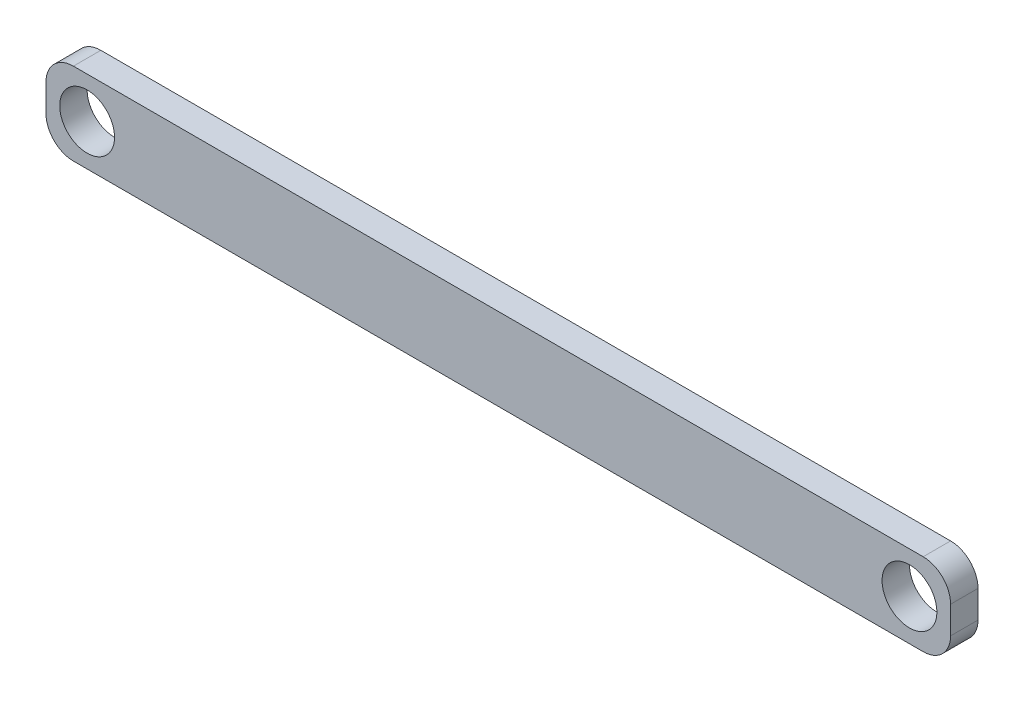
from build123d import *

# Parameters (mm, degrees)
CROQUIS1_R              = 10
SALIENTE_EXTRUIR1_DEPTH = 5


with BuildPart() as part:
    # Croquis1 → Saliente-Extruir1 (new, symmetric)
    with BuildSketch(Plane.XY):
        with BuildLine():
            Line((-155, 15), (155, 15))
            ThreePointArc((155, 15), (162.071067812, 12.071067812), (165, 5))
            Line((165, 5), (165, -5))
            ThreePointArc((165, -5), (162.071067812, -12.071067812), (155, -15))
            Line((155, -15), (-155, -15))
            ThreePointArc((-155, -15), (-162.071067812, -12.071067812), (-165, -5))
            Line((-165, -5), (-165, 5))
            ThreePointArc((-165, 5), (-162.071067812, 12.071067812), (-155, 15))
        make_face()
        with Locations((-150, 0)):
            Circle(CROQUIS1_R, mode=Mode.SUBTRACT)
        with Locations((150, 0)):
            Circle(CROQUIS1_R, mode=Mode.SUBTRACT)
    extrude(amount=SALIENTE_EXTRUIR1_DEPTH, both=True)


solid = part.part
